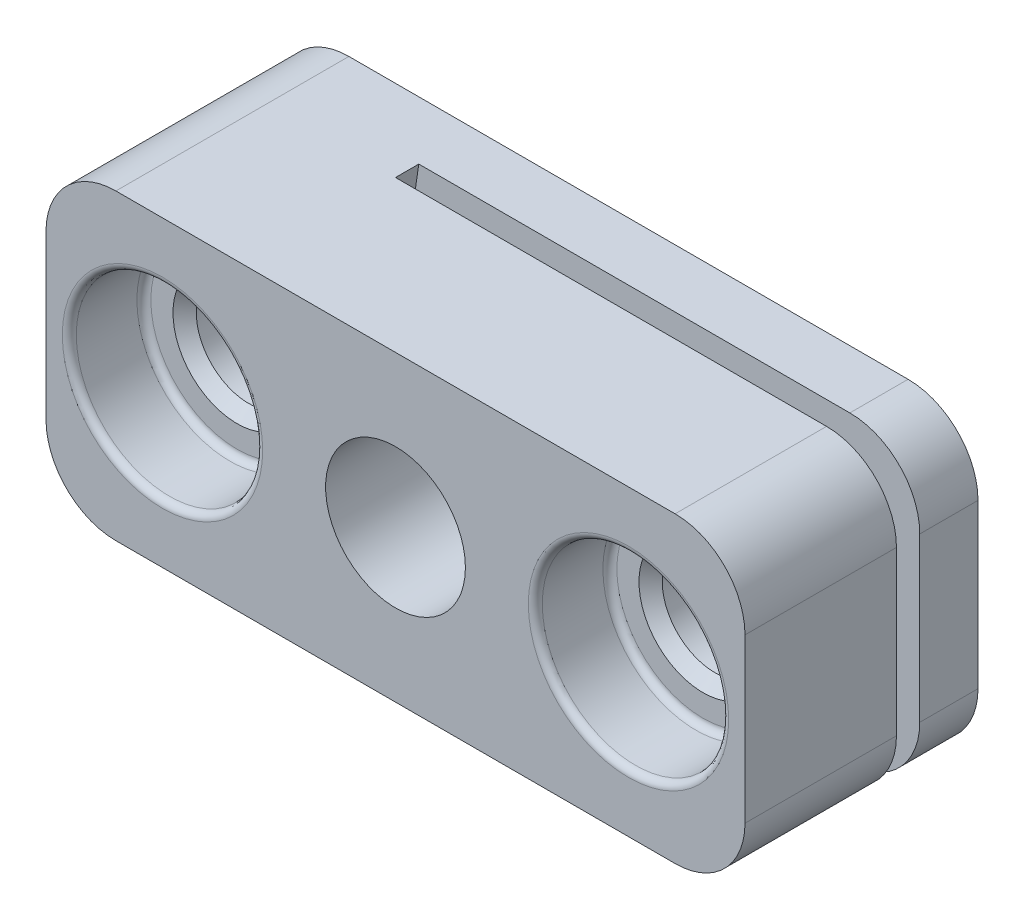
ISO-10303-21;
HEADER;
FILE_DESCRIPTION(('STEP AP214'),'2;1');
FILE_NAME('part.step','',(''),(''),'','','');
FILE_SCHEMA(('AUTOMOTIVE_DESIGN { 1 0 10303 214 1 1 1 1 }'));
ENDSEC;
DATA;
#1=APPLICATION_CONTEXT('core data for automotive mechanical design processes');
#2=APPLICATION_PROTOCOL_DEFINITION('international standard','automotive_design',2000,#1);
#3=PRODUCT_CONTEXT('',#1,'mechanical');
#4=PRODUCT('Part','Part','',(#3));
#5=PRODUCT_RELATED_PRODUCT_CATEGORY('part','',(#4));
#6=PRODUCT_DEFINITION_FORMATION('','',#4);
#7=PRODUCT_DEFINITION_CONTEXT('part definition',#1,'design');
#8=PRODUCT_DEFINITION('design','',#6,#7);
#9=PRODUCT_DEFINITION_SHAPE('','',#8);
#10=(LENGTH_UNIT() NAMED_UNIT(*) SI_UNIT(.MILLI.,.METRE.));
#11=(NAMED_UNIT(*) PLANE_ANGLE_UNIT() SI_UNIT($,.RADIAN.));
#12=(NAMED_UNIT(*) SI_UNIT($,.STERADIAN.) SOLID_ANGLE_UNIT());
#13=UNCERTAINTY_MEASURE_WITH_UNIT(LENGTH_MEASURE(1.E-05),#10,'distance_accuracy_value','');
#14=(GEOMETRIC_REPRESENTATION_CONTEXT(3) GLOBAL_UNCERTAINTY_ASSIGNED_CONTEXT((#13)) GLOBAL_UNIT_ASSIGNED_CONTEXT((#10,
#11,#12)) REPRESENTATION_CONTEXT('',''));
#15=CARTESIAN_POINT('',(0.,0.,0.));
#16=DIRECTION('',(0.,0.,1.));
#17=DIRECTION('',(1.,0.,0.));
#18=AXIS2_PLACEMENT_3D('',#15,#16,#17);
#19=CARTESIAN_POINT('',(22.75,0.,6.8));
#20=DIRECTION('',(0.,0.,1.));
#21=DIRECTION('',(1.,0.,0.));
#22=AXIS2_PLACEMENT_3D('',#19,#20,#21);
#23=PLANE('',#22);
#24=CARTESIAN_POINT('',(20.,0.,6.79999999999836));
#25=DIRECTION('',(0.,0.,1.));
#26=DIRECTION('',(1.,0.,0.));
#27=AXIS2_PLACEMENT_3D('',#24,#25,#26);
#28=CIRCLE('',#27,2.74999999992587);
#29=CARTESIAN_POINT('',(22.7499999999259,0.,6.79999999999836));
#30=VERTEX_POINT('',#29);
#31=EDGE_CURVE('E18',#30,#30,#28,.F.);
#32=ORIENTED_EDGE('',*,*,#31,.T.);
#33=EDGE_LOOP('',(#32));
#34=FACE_BOUND('',#33,.T.);
#35=CARTESIAN_POINT('',(20.,0.,6.8));
#36=DIRECTION('',(0.,0.,-1.));
#37=DIRECTION('',(1.,0.,0.));
#38=AXIS2_PLACEMENT_3D('',#35,#36,#37);
#39=CIRCLE('',#38,3.70000000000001);
#40=CARTESIAN_POINT('',(23.7,0.,6.8));
#41=VERTEX_POINT('',#40);
#42=EDGE_CURVE('E285',#41,#41,#39,.F.);
#43=ORIENTED_EDGE('',*,*,#42,.T.);
#44=EDGE_LOOP('',(#43));
#45=FACE_BOUND('',#44,.T.);
#46=ADVANCED_FACE('F14',(#34,#45),#23,.T.);
#47=CARTESIAN_POINT('',(20.,0.,7.1));
#48=DIRECTION('',(0.,0.,1.));
#49=DIRECTION('',(1.,0.,0.));
#50=AXIS2_PLACEMENT_3D('',#47,#48,#49);
#51=TOROIDAL_SURFACE('',#50,3.7,0.300000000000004);
#52=CARTESIAN_POINT('',(20.,0.,7.09999999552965));
#53=DIRECTION('',(0.,0.,-1.));
#54=DIRECTION('',(-1.,0.,0.));
#55=AXIS2_PLACEMENT_3D('',#52,#53,#54);
#56=CIRCLE('',#55,4.);
#57=CARTESIAN_POINT('',(16.,0.,7.09999999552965));
#58=VERTEX_POINT('',#57);
#59=EDGE_CURVE('E234',#58,#58,#56,.F.);
#60=ORIENTED_EDGE('',*,*,#59,.T.);
#61=EDGE_LOOP('',(#60));
#62=FACE_BOUND('',#61,.T.);
#63=ORIENTED_EDGE('',*,*,#42,.F.);
#64=EDGE_LOOP('',(#63));
#65=FACE_BOUND('',#64,.T.);
#66=ADVANCED_FACE('F267',(#62,#65),#51,.F.);
#67=CARTESIAN_POINT('',(0.,0.,7.1));
#68=DIRECTION('',(0.,0.,-1.));
#69=DIRECTION('',(-1.,0.,0.));
#70=AXIS2_PLACEMENT_3D('',#67,#68,#69);
#71=TOROIDAL_SURFACE('',#70,3.7,0.3);
#72=CARTESIAN_POINT('',(0.,0.,6.8));
#73=DIRECTION('',(0.,0.,-1.));
#74=DIRECTION('',(-1.,0.,0.));
#75=AXIS2_PLACEMENT_3D('',#72,#73,#74);
#76=CIRCLE('',#75,3.7);
#77=CARTESIAN_POINT('',(-3.7,0.,6.8));
#78=VERTEX_POINT('',#77);
#79=EDGE_CURVE('E245',#78,#78,#76,.F.);
#80=ORIENTED_EDGE('',*,*,#79,.F.);
#81=EDGE_LOOP('',(#80));
#82=FACE_BOUND('',#81,.T.);
#83=CARTESIAN_POINT('',(0.,0.,7.1));
#84=DIRECTION('',(0.,0.,1.));
#85=DIRECTION('',(1.,0.,0.));
#86=AXIS2_PLACEMENT_3D('',#83,#84,#85);
#87=CIRCLE('',#86,4.);
#88=CARTESIAN_POINT('',(4.,0.,7.1));
#89=VERTEX_POINT('',#88);
#90=EDGE_CURVE('E231',#89,#89,#87,.T.);
#91=ORIENTED_EDGE('',*,*,#90,.T.);
#92=EDGE_LOOP('',(#91));
#93=FACE_BOUND('',#92,.T.);
#94=ADVANCED_FACE('F263',(#82,#93),#71,.F.);
#95=CARTESIAN_POINT('',(-3.7,0.,6.8));
#96=DIRECTION('',(0.,0.,1.));
#97=DIRECTION('',(1.,0.,0.));
#98=AXIS2_PLACEMENT_3D('',#95,#96,#97);
#99=PLANE('',#98);
#100=ORIENTED_EDGE('',*,*,#79,.T.);
#101=EDGE_LOOP('',(#100));
#102=FACE_BOUND('',#101,.T.);
#103=CARTESIAN_POINT('',(0.,0.,6.79999999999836));
#104=DIRECTION('',(0.,0.,1.));
#105=DIRECTION('',(1.,0.,0.));
#106=AXIS2_PLACEMENT_3D('',#103,#104,#105);
#107=CIRCLE('',#106,2.75000000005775);
#108=CARTESIAN_POINT('',(2.75000000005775,0.,6.79999999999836));
#109=VERTEX_POINT('',#108);
#110=EDGE_CURVE('E228',#109,#109,#107,.F.);
#111=ORIENTED_EDGE('',*,*,#110,.T.);
#112=EDGE_LOOP('',(#111));
#113=FACE_BOUND('',#112,.T.);
#114=ADVANCED_FACE('F252',(#102,#113),#99,.T.);
#115=CARTESIAN_POINT('',(20.,0.,6.79999999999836));
#116=DIRECTION('',(0.,0.,1.));
#117=DIRECTION('',(1.,0.,0.));
#118=AXIS2_PLACEMENT_3D('',#115,#116,#117);
#119=CONICAL_SURFACE('',#118,2.74999999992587,0.785398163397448);
#120=CARTESIAN_POINT('',(20.,0.,6.3));
#121=DIRECTION('',(0.,0.,-1.));
#122=DIRECTION('',(-1.,0.,0.));
#123=AXIS2_PLACEMENT_3D('',#120,#121,#122);
#124=CIRCLE('',#123,2.25);
#125=CARTESIAN_POINT('',(17.75,0.,6.3));
#126=VERTEX_POINT('',#125);
#127=EDGE_CURVE('E224',#126,#126,#124,.T.);
#128=ORIENTED_EDGE('',*,*,#127,.T.);
#129=EDGE_LOOP('',(#128));
#130=FACE_BOUND('',#129,.T.);
#131=ORIENTED_EDGE('',*,*,#31,.F.);
#132=EDGE_LOOP('',(#131));
#133=FACE_BOUND('',#132,.T.);
#134=ADVANCED_FACE('F262',(#130,#133),#119,.F.);
#135=CARTESIAN_POINT('',(20.,0.,10.));
#136=DIRECTION('',(0.,0.,-1.));
#137=DIRECTION('',(-1.,0.,0.));
#138=AXIS2_PLACEMENT_3D('',#135,#136,#137);
#139=CYLINDRICAL_SURFACE('',#138,4.);
#140=ORIENTED_EDGE('',*,*,#59,.F.);
#141=EDGE_LOOP('',(#140));
#142=FACE_BOUND('',#141,.T.);
#143=CARTESIAN_POINT('',(20.,0.,9.7));
#144=DIRECTION('',(0.,0.,1.));
#145=DIRECTION('',(1.,0.,0.));
#146=AXIS2_PLACEMENT_3D('',#143,#144,#145);
#147=CIRCLE('',#146,4.);
#148=CARTESIAN_POINT('',(24.,0.,9.7));
#149=VERTEX_POINT('',#148);
#150=EDGE_CURVE('E125',#149,#149,#147,.F.);
#151=ORIENTED_EDGE('',*,*,#150,.F.);
#152=EDGE_LOOP('',(#151));
#153=FACE_BOUND('',#152,.T.);
#154=ADVANCED_FACE('F505',(#142,#153),#139,.F.);
#155=CARTESIAN_POINT('',(0.,0.,0.));
#156=DIRECTION('',(0.,0.,1.));
#157=DIRECTION('',(1.,0.,0.));
#158=AXIS2_PLACEMENT_3D('',#155,#156,#157);
#159=CYLINDRICAL_SURFACE('',#158,4.);
#160=CARTESIAN_POINT('',(0.,0.,9.7));
#161=DIRECTION('',(0.,0.,-1.));
#162=DIRECTION('',(-1.,0.,0.));
#163=AXIS2_PLACEMENT_3D('',#160,#161,#162);
#164=CIRCLE('',#163,4.);
#165=CARTESIAN_POINT('',(-4.,0.,9.7));
#166=VERTEX_POINT('',#165);
#167=EDGE_CURVE('E171',#166,#166,#164,.T.);
#168=ORIENTED_EDGE('',*,*,#167,.F.);
#169=EDGE_LOOP('',(#168));
#170=FACE_BOUND('',#169,.T.);
#171=ORIENTED_EDGE('',*,*,#90,.F.);
#172=EDGE_LOOP('',(#171));
#173=FACE_BOUND('',#172,.T.);
#174=ADVANCED_FACE('F349',(#170,#173),#159,.F.);
#175=CARTESIAN_POINT('',(0.,0.,6.79999999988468));
#176=DIRECTION('',(0.,0.,1.));
#177=DIRECTION('',(1.,0.,0.));
#178=AXIS2_PLACEMENT_3D('',#175,#176,#177);
#179=CONICAL_SURFACE('',#178,2.74999999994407,0.785398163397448);
#180=ORIENTED_EDGE('',*,*,#110,.F.);
#181=EDGE_LOOP('',(#180));
#182=FACE_BOUND('',#181,.T.);
#183=CARTESIAN_POINT('',(0.,0.,6.3));
#184=DIRECTION('',(0.,0.,1.));
#185=DIRECTION('',(1.,0.,0.));
#186=AXIS2_PLACEMENT_3D('',#183,#184,#185);
#187=CIRCLE('',#186,2.25);
#188=CARTESIAN_POINT('',(2.25,0.,6.3));
#189=VERTEX_POINT('',#188);
#190=EDGE_CURVE('E167',#189,#189,#187,.F.);
#191=ORIENTED_EDGE('',*,*,#190,.T.);
#192=EDGE_LOOP('',(#191));
#193=FACE_BOUND('',#192,.T.);
#194=ADVANCED_FACE('F345',(#182,#193),#179,.F.);
#195=CARTESIAN_POINT('',(20.,0.,10.));
#196=DIRECTION('',(0.,0.,-1.));
#197=DIRECTION('',(-1.,0.,0.));
#198=AXIS2_PLACEMENT_3D('',#195,#196,#197);
#199=CYLINDRICAL_SURFACE('',#198,2.25);
#200=CARTESIAN_POINT('',(20.,0.,3.5));
#201=DIRECTION('',(0.,0.,-1.));
#202=DIRECTION('',(-1.,0.,0.));
#203=AXIS2_PLACEMENT_3D('',#200,#201,#202);
#204=CIRCLE('',#203,2.25);
#205=CARTESIAN_POINT('',(17.75,0.,3.5));
#206=VERTEX_POINT('',#205);
#207=EDGE_CURVE('E135',#206,#206,#204,.T.);
#208=ORIENTED_EDGE('',*,*,#207,.T.);
#209=EDGE_LOOP('',(#208));
#210=FACE_BOUND('',#209,.T.);
#211=ORIENTED_EDGE('',*,*,#127,.F.);
#212=EDGE_LOOP('',(#211));
#213=FACE_BOUND('',#212,.T.);
#214=ADVANCED_FACE('F348',(#210,#213),#199,.F.);
#215=CARTESIAN_POINT('',(42.9683417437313,0.,3.5));
#216=DIRECTION('',(0.,0.,1.));
#217=DIRECTION('',(1.,0.,0.));
#218=AXIS2_PLACEMENT_3D('',#215,#216,#217);
#219=CYLINDRICAL_SURFACE('',#218,39.9999999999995);
#220=DIRECTION('',(0.,0.,1.));
#221=VECTOR('',#220,1.);
#222=CARTESIAN_POINT('',(3.5,6.5,3.5));
#223=LINE('',#222,#221);
#224=CARTESIAN_POINT('',(3.5,6.5,3.5));
#225=VERTEX_POINT('',#224);
#226=CARTESIAN_POINT('',(3.5,6.5,2.5));
#227=VERTEX_POINT('',#226);
#228=EDGE_CURVE('E113',#225,#227,#223,.F.);
#229=ORIENTED_EDGE('',*,*,#228,.F.);
#230=CARTESIAN_POINT('',(42.9683417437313,0.,3.5));
#231=DIRECTION('',(0.,0.,1.));
#232=DIRECTION('',(1.,0.,0.));
#233=AXIS2_PLACEMENT_3D('',#230,#231,#232);
#234=CIRCLE('',#233,39.9999999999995);
#235=CARTESIAN_POINT('',(3.50000000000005,-6.5,3.5));
#236=VERTEX_POINT('',#235);
#237=EDGE_CURVE('E177',#225,#236,#234,.T.);
#238=ORIENTED_EDGE('',*,*,#237,.T.);
#239=DIRECTION('',(0.,0.,1.));
#240=VECTOR('',#239,1.);
#241=CARTESIAN_POINT('',(3.50000000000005,-6.5,3.5));
#242=LINE('',#241,#240);
#243=CARTESIAN_POINT('',(3.50000000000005,-6.5,2.5));
#244=VERTEX_POINT('',#243);
#245=EDGE_CURVE('E126',#244,#236,#242,.T.);
#246=ORIENTED_EDGE('',*,*,#245,.F.);
#247=CARTESIAN_POINT('',(42.9683417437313,0.,2.5));
#248=DIRECTION('',(0.,0.,1.));
#249=DIRECTION('',(1.,0.,0.));
#250=AXIS2_PLACEMENT_3D('',#247,#248,#249);
#251=CIRCLE('',#250,39.9999999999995);
#252=EDGE_CURVE('E130',#227,#244,#251,.T.);
#253=ORIENTED_EDGE('',*,*,#252,.F.);
#254=EDGE_LOOP('',(#229,#238,#246,#253));
#255=FACE_BOUND('',#254,.T.);
#256=ADVANCED_FACE('F131',(#255),#219,.F.);
#257=CARTESIAN_POINT('',(20.,0.,9.7));
#258=DIRECTION('',(0.,0.,1.));
#259=DIRECTION('',(1.,0.,0.));
#260=AXIS2_PLACEMENT_3D('',#257,#258,#259);
#261=TOROIDAL_SURFACE('',#260,4.3,0.3);
#262=ORIENTED_EDGE('',*,*,#150,.T.);
#263=EDGE_LOOP('',(#262));
#264=FACE_BOUND('',#263,.T.);
#265=CARTESIAN_POINT('',(20.,0.,10.));
#266=DIRECTION('',(0.,0.,1.));
#267=DIRECTION('',(1.,0.,0.));
#268=AXIS2_PLACEMENT_3D('',#265,#266,#267);
#269=CIRCLE('',#268,4.3);
#270=CARTESIAN_POINT('',(24.3,0.,10.));
#271=VERTEX_POINT('',#270);
#272=EDGE_CURVE('E215',#271,#271,#269,.F.);
#273=ORIENTED_EDGE('',*,*,#272,.F.);
#274=EDGE_LOOP('',(#273));
#275=FACE_BOUND('',#274,.T.);
#276=ADVANCED_FACE('F189',(#264,#275),#261,.T.);
#277=CARTESIAN_POINT('',(0.,0.,9.7));
#278=DIRECTION('',(0.,0.,-1.));
#279=DIRECTION('',(-1.,0.,0.));
#280=AXIS2_PLACEMENT_3D('',#277,#278,#279);
#281=TOROIDAL_SURFACE('',#280,4.3,0.3);
#282=CARTESIAN_POINT('',(0.,0.,10.));
#283=DIRECTION('',(0.,0.,1.));
#284=DIRECTION('',(-1.,0.,0.));
#285=AXIS2_PLACEMENT_3D('',#282,#283,#284);
#286=CIRCLE('',#285,4.3);
#287=CARTESIAN_POINT('',(-4.3,0.,10.));
#288=VERTEX_POINT('',#287);
#289=EDGE_CURVE('E331',#288,#288,#286,.F.);
#290=ORIENTED_EDGE('',*,*,#289,.F.);
#291=EDGE_LOOP('',(#290));
#292=FACE_BOUND('',#291,.T.);
#293=ORIENTED_EDGE('',*,*,#167,.T.);
#294=EDGE_LOOP('',(#293));
#295=FACE_BOUND('',#294,.T.);
#296=ADVANCED_FACE('F183',(#292,#295),#281,.T.);
#297=CARTESIAN_POINT('',(25.,-3.5,10.));
#298=DIRECTION('',(-1.,0.,0.));
#299=DIRECTION('',(0.,0.,1.));
#300=AXIS2_PLACEMENT_3D('',#297,#298,#299);
#301=PLANE('',#300);
#302=DIRECTION('',(0.,1.,0.));
#303=VECTOR('',#302,1.);
#304=CARTESIAN_POINT('',(25.,0.,3.5));
#305=LINE('',#304,#303);
#306=CARTESIAN_POINT('',(25.,-3.5,3.5));
#307=VERTEX_POINT('',#306);
#308=CARTESIAN_POINT('',(25.,3.5,3.5));
#309=VERTEX_POINT('',#308);
#310=EDGE_CURVE('E334',#307,#309,#305,.T.);
#311=ORIENTED_EDGE('',*,*,#310,.T.);
#312=DIRECTION('',(0.,0.,1.));
#313=VECTOR('',#312,1.);
#314=CARTESIAN_POINT('',(25.,3.5,10.));
#315=LINE('',#314,#313);
#316=CARTESIAN_POINT('',(25.,3.5,10.));
#317=VERTEX_POINT('',#316);
#318=EDGE_CURVE('E174',#317,#309,#315,.F.);
#319=ORIENTED_EDGE('',*,*,#318,.F.);
#320=DIRECTION('',(0.,1.,0.));
#321=VECTOR('',#320,1.);
#322=CARTESIAN_POINT('',(25.,-3.5,10.));
#323=LINE('',#322,#321);
#324=CARTESIAN_POINT('',(25.,-3.5,10.));
#325=VERTEX_POINT('',#324);
#326=EDGE_CURVE('E327',#325,#317,#323,.T.);
#327=ORIENTED_EDGE('',*,*,#326,.F.);
#328=DIRECTION('',(0.,0.,1.));
#329=VECTOR('',#328,1.);
#330=CARTESIAN_POINT('',(25.,-3.5,10.));
#331=LINE('',#330,#329);
#332=EDGE_CURVE('E170',#307,#325,#331,.T.);
#333=ORIENTED_EDGE('',*,*,#332,.F.);
#334=EDGE_LOOP('',(#311,#319,#327,#333));
#335=FACE_BOUND('',#334,.T.);
#336=ADVANCED_FACE('F188',(#335),#301,.F.);
#337=CARTESIAN_POINT('',(20.,0.,10.));
#338=DIRECTION('',(0.,0.,-1.));
#339=DIRECTION('',(-1.,0.,0.));
#340=AXIS2_PLACEMENT_3D('',#337,#338,#339);
#341=CYLINDRICAL_SURFACE('',#340,2.25);
#342=CARTESIAN_POINT('',(20.,0.,0.499999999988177));
#343=DIRECTION('',(0.,0.,-1.));
#344=DIRECTION('',(-1.,0.,0.));
#345=AXIS2_PLACEMENT_3D('',#342,#343,#344);
#346=CIRCLE('',#345,2.25000000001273);
#347=CARTESIAN_POINT('',(17.7499999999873,0.,0.499999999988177));
#348=VERTEX_POINT('',#347);
#349=EDGE_CURVE('E326',#348,#348,#346,.T.);
#350=ORIENTED_EDGE('',*,*,#349,.T.);
#351=EDGE_LOOP('',(#350));
#352=FACE_BOUND('',#351,.T.);
#353=CARTESIAN_POINT('',(20.,0.,2.5));
#354=DIRECTION('',(0.,0.,-1.));
#355=DIRECTION('',(-1.,0.,0.));
#356=AXIS2_PLACEMENT_3D('',#353,#354,#355);
#357=CIRCLE('',#356,2.25);
#358=CARTESIAN_POINT('',(17.75,0.,2.5));
#359=VERTEX_POINT('',#358);
#360=EDGE_CURVE('E136',#359,#359,#357,.T.);
#361=ORIENTED_EDGE('',*,*,#360,.F.);
#362=EDGE_LOOP('',(#361));
#363=FACE_BOUND('',#362,.T.);
#364=ADVANCED_FACE('F357',(#352,#363),#341,.F.);
#365=CARTESIAN_POINT('',(0.,0.,0.));
#366=DIRECTION('',(0.,0.,1.));
#367=DIRECTION('',(1.,0.,0.));
#368=AXIS2_PLACEMENT_3D('',#365,#366,#367);
#369=CYLINDRICAL_SURFACE('',#368,2.25);
#370=ORIENTED_EDGE('',*,*,#190,.F.);
#371=EDGE_LOOP('',(#370));
#372=FACE_BOUND('',#371,.T.);
#373=CARTESIAN_POINT('',(0.,0.,0.499999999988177));
#374=DIRECTION('',(0.,0.,-1.));
#375=DIRECTION('',(-1.,0.,0.));
#376=AXIS2_PLACEMENT_3D('',#373,#374,#375);
#377=CIRCLE('',#376,2.2499999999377);
#378=CARTESIAN_POINT('',(-2.2499999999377,0.,0.499999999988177));
#379=VERTEX_POINT('',#378);
#380=EDGE_CURVE('E323',#379,#379,#377,.T.);
#381=ORIENTED_EDGE('',*,*,#380,.T.);
#382=EDGE_LOOP('',(#381));
#383=FACE_BOUND('',#382,.T.);
#384=ADVANCED_FACE('F353',(#372,#383),#369,.F.);
#385=CARTESIAN_POINT('',(22.,-3.5,10.));
#386=DIRECTION('',(0.,0.,1.));
#387=DIRECTION('',(1.,0.,0.));
#388=AXIS2_PLACEMENT_3D('',#385,#386,#387);
#389=CYLINDRICAL_SURFACE('',#388,3.);
#390=ORIENTED_EDGE('',*,*,#332,.T.);
#391=CARTESIAN_POINT('',(22.,-3.5,10.));
#392=DIRECTION('',(0.,0.,1.));
#393=DIRECTION('',(1.,0.,0.));
#394=AXIS2_PLACEMENT_3D('',#391,#392,#393);
#395=CIRCLE('',#394,3.);
#396=CARTESIAN_POINT('',(22.,-6.5,10.));
#397=VERTEX_POINT('',#396);
#398=EDGE_CURVE('E328',#397,#325,#395,.T.);
#399=ORIENTED_EDGE('',*,*,#398,.F.);
#400=DIRECTION('',(0.,0.,1.));
#401=VECTOR('',#400,1.);
#402=CARTESIAN_POINT('',(22.,-6.5,10.));
#403=LINE('',#402,#401);
#404=CARTESIAN_POINT('',(22.,-6.5,3.5));
#405=VERTEX_POINT('',#404);
#406=EDGE_CURVE('E157',#397,#405,#403,.F.);
#407=ORIENTED_EDGE('',*,*,#406,.T.);
#408=CARTESIAN_POINT('',(22.,-3.5,3.5));
#409=DIRECTION('',(0.,0.,1.));
#410=DIRECTION('',(1.,0.,0.));
#411=AXIS2_PLACEMENT_3D('',#408,#409,#410);
#412=CIRCLE('',#411,3.);
#413=EDGE_CURVE('E335',#405,#307,#412,.T.);
#414=ORIENTED_EDGE('',*,*,#413,.T.);
#415=EDGE_LOOP('',(#390,#399,#407,#414));
#416=FACE_BOUND('',#415,.T.);
#417=ADVANCED_FACE('F356',(#416),#389,.T.);
#418=CARTESIAN_POINT('',(42.9683417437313,0.,2.5));
#419=DIRECTION('',(0.,0.,1.));
#420=DIRECTION('',(1.,0.,0.));
#421=AXIS2_PLACEMENT_3D('',#418,#419,#420);
#422=PLANE('',#421);
#423=CARTESIAN_POINT('',(10.,0.,2.5));
#424=DIRECTION('',(0.,0.,1.));
#425=DIRECTION('',(1.,0.,0.));
#426=AXIS2_PLACEMENT_3D('',#423,#424,#425);
#427=CIRCLE('',#426,3.00000000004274);
#428=CARTESIAN_POINT('',(13.0000000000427,0.,2.5));
#429=VERTEX_POINT('',#428);
#430=EDGE_CURVE('E455',#429,#429,#427,.T.);
#431=ORIENTED_EDGE('',*,*,#430,.F.);
#432=EDGE_LOOP('',(#431));
#433=FACE_BOUND('',#432,.T.);
#434=ORIENTED_EDGE('',*,*,#252,.T.);
#435=DIRECTION('',(1.,0.,0.));
#436=VECTOR('',#435,1.);
#437=CARTESIAN_POINT('',(-2.,-6.5,2.5));
#438=LINE('',#437,#436);
#439=CARTESIAN_POINT('',(22.,-6.5,2.5));
#440=VERTEX_POINT('',#439);
#441=EDGE_CURVE('E153',#244,#440,#438,.T.);
#442=ORIENTED_EDGE('',*,*,#441,.T.);
#443=CARTESIAN_POINT('',(22.,-3.5,2.5));
#444=DIRECTION('',(0.,0.,1.));
#445=DIRECTION('',(1.,0.,0.));
#446=AXIS2_PLACEMENT_3D('',#443,#444,#445);
#447=CIRCLE('',#446,3.);
#448=CARTESIAN_POINT('',(25.,-3.5,2.5));
#449=VERTEX_POINT('',#448);
#450=EDGE_CURVE('E164',#449,#440,#447,.F.);
#451=ORIENTED_EDGE('',*,*,#450,.F.);
#452=DIRECTION('',(0.,1.,0.));
#453=VECTOR('',#452,1.);
#454=CARTESIAN_POINT('',(25.,-3.5,2.5));
#455=LINE('',#454,#453);
#456=CARTESIAN_POINT('',(25.,3.5,2.5));
#457=VERTEX_POINT('',#456);
#458=EDGE_CURVE('E150',#449,#457,#455,.T.);
#459=ORIENTED_EDGE('',*,*,#458,.T.);
#460=CARTESIAN_POINT('',(22.,3.5,2.5));
#461=DIRECTION('',(0.,0.,1.));
#462=DIRECTION('',(1.,0.,0.));
#463=AXIS2_PLACEMENT_3D('',#460,#461,#462);
#464=CIRCLE('',#463,3.);
#465=CARTESIAN_POINT('',(22.,6.5,2.5));
#466=VERTEX_POINT('',#465);
#467=EDGE_CURVE('E141',#466,#457,#464,.F.);
#468=ORIENTED_EDGE('',*,*,#467,.F.);
#469=DIRECTION('',(1.,0.,0.));
#470=VECTOR('',#469,1.);
#471=CARTESIAN_POINT('',(22.,6.5,2.5));
#472=LINE('',#471,#470);
#473=EDGE_CURVE('E117',#466,#227,#472,.F.);
#474=ORIENTED_EDGE('',*,*,#473,.T.);
#475=EDGE_LOOP('',(#434,#442,#451,#459,#468,#474));
#476=FACE_BOUND('',#475,.T.);
#477=ORIENTED_EDGE('',*,*,#360,.T.);
#478=EDGE_LOOP('',(#477));
#479=FACE_BOUND('',#478,.T.);
#480=ADVANCED_FACE('F138',(#433,#476,#479),#422,.T.);
#481=CARTESIAN_POINT('',(42.9683417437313,0.,3.5));
#482=DIRECTION('',(0.,0.,1.));
#483=DIRECTION('',(1.,0.,0.));
#484=AXIS2_PLACEMENT_3D('',#481,#482,#483);
#485=PLANE('',#484);
#486=CARTESIAN_POINT('',(10.,0.,3.5));
#487=DIRECTION('',(0.,0.,1.));
#488=DIRECTION('',(1.,0.,0.));
#489=AXIS2_PLACEMENT_3D('',#486,#487,#488);
#490=CIRCLE('',#489,3.00000000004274);
#491=CARTESIAN_POINT('',(13.0000000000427,0.,3.5));
#492=VERTEX_POINT('',#491);
#493=EDGE_CURVE('E458',#492,#492,#490,.T.);
#494=ORIENTED_EDGE('',*,*,#493,.T.);
#495=EDGE_LOOP('',(#494));
#496=FACE_BOUND('',#495,.T.);
#497=ORIENTED_EDGE('',*,*,#237,.F.);
#498=DIRECTION('',(1.,0.,0.));
#499=VECTOR('',#498,1.);
#500=CARTESIAN_POINT('',(22.,6.5,3.5));
#501=LINE('',#500,#499);
#502=CARTESIAN_POINT('',(22.,6.5,3.5));
#503=VERTEX_POINT('',#502);
#504=EDGE_CURVE('E121',#225,#503,#501,.T.);
#505=ORIENTED_EDGE('',*,*,#504,.T.);
#506=CARTESIAN_POINT('',(22.,3.5,3.5));
#507=DIRECTION('',(0.,0.,1.));
#508=DIRECTION('',(1.,0.,0.));
#509=AXIS2_PLACEMENT_3D('',#506,#507,#508);
#510=CIRCLE('',#509,3.);
#511=EDGE_CURVE('E176',#309,#503,#510,.T.);
#512=ORIENTED_EDGE('',*,*,#511,.F.);
#513=ORIENTED_EDGE('',*,*,#310,.F.);
#514=ORIENTED_EDGE('',*,*,#413,.F.);
#515=DIRECTION('',(1.,0.,0.));
#516=VECTOR('',#515,1.);
#517=CARTESIAN_POINT('',(-2.,-6.5,3.5));
#518=LINE('',#517,#516);
#519=EDGE_CURVE('E160',#405,#236,#518,.F.);
#520=ORIENTED_EDGE('',*,*,#519,.T.);
#521=EDGE_LOOP('',(#497,#505,#512,#513,#514,#520));
#522=FACE_BOUND('',#521,.T.);
#523=ORIENTED_EDGE('',*,*,#207,.F.);
#524=EDGE_LOOP('',(#523));
#525=FACE_BOUND('',#524,.T.);
#526=ADVANCED_FACE('F418',(#496,#522,#525),#485,.F.);
#527=CARTESIAN_POINT('',(22.,3.5,10.));
#528=DIRECTION('',(0.,0.,1.));
#529=DIRECTION('',(1.,0.,0.));
#530=AXIS2_PLACEMENT_3D('',#527,#528,#529);
#531=CYLINDRICAL_SURFACE('',#530,3.);
#532=DIRECTION('',(0.,0.,-1.));
#533=VECTOR('',#532,1.);
#534=CARTESIAN_POINT('',(22.,6.5,10.));
#535=LINE('',#534,#533);
#536=CARTESIAN_POINT('',(22.,6.5,10.));
#537=VERTEX_POINT('',#536);
#538=EDGE_CURVE('E144',#503,#537,#535,.F.);
#539=ORIENTED_EDGE('',*,*,#538,.T.);
#540=CARTESIAN_POINT('',(22.,3.5,10.));
#541=DIRECTION('',(0.,0.,1.));
#542=DIRECTION('',(1.,0.,0.));
#543=AXIS2_PLACEMENT_3D('',#540,#541,#542);
#544=CIRCLE('',#543,3.);
#545=EDGE_CURVE('E324',#317,#537,#544,.T.);
#546=ORIENTED_EDGE('',*,*,#545,.F.);
#547=ORIENTED_EDGE('',*,*,#318,.T.);
#548=ORIENTED_EDGE('',*,*,#511,.T.);
#549=EDGE_LOOP('',(#539,#546,#547,#548));
#550=FACE_BOUND('',#549,.T.);
#551=ADVANCED_FACE('F394',(#550),#531,.T.);
#552=CARTESIAN_POINT('',(-2.,-3.5,10.));
#553=DIRECTION('',(0.,0.,1.));
#554=DIRECTION('',(1.,0.,0.));
#555=AXIS2_PLACEMENT_3D('',#552,#553,#554);
#556=PLANE('',#555);
#557=DIRECTION('',(1.,0.,0.));
#558=VECTOR('',#557,1.);
#559=CARTESIAN_POINT('',(22.,6.5,10.));
#560=LINE('',#559,#558);
#561=CARTESIAN_POINT('',(-2.,6.5,10.));
#562=VERTEX_POINT('',#561);
#563=EDGE_CURVE('E146',#537,#562,#560,.F.);
#564=ORIENTED_EDGE('',*,*,#563,.T.);
#565=CARTESIAN_POINT('',(-2.,3.5,10.));
#566=DIRECTION('',(0.,0.,1.));
#567=DIRECTION('',(1.,0.,0.));
#568=AXIS2_PLACEMENT_3D('',#565,#566,#567);
#569=CIRCLE('',#568,3.);
#570=CARTESIAN_POINT('',(-5.,3.5,10.));
#571=VERTEX_POINT('',#570);
#572=EDGE_CURVE('E315',#571,#562,#569,.F.);
#573=ORIENTED_EDGE('',*,*,#572,.F.);
#574=DIRECTION('',(0.,1.,0.));
#575=VECTOR('',#574,1.);
#576=CARTESIAN_POINT('',(-5.,3.5,10.));
#577=LINE('',#576,#575);
#578=CARTESIAN_POINT('',(-5.,-3.5,10.));
#579=VERTEX_POINT('',#578);
#580=EDGE_CURVE('E372',#571,#579,#577,.F.);
#581=ORIENTED_EDGE('',*,*,#580,.T.);
#582=CARTESIAN_POINT('',(-2.,-3.5,10.));
#583=DIRECTION('',(0.,0.,1.));
#584=DIRECTION('',(1.,0.,0.));
#585=AXIS2_PLACEMENT_3D('',#582,#583,#584);
#586=CIRCLE('',#585,3.);
#587=CARTESIAN_POINT('',(-2.,-6.5,10.));
#588=VERTEX_POINT('',#587);
#589=EDGE_CURVE('E156',#588,#579,#586,.F.);
#590=ORIENTED_EDGE('',*,*,#589,.F.);
#591=DIRECTION('',(1.,0.,0.));
#592=VECTOR('',#591,1.);
#593=CARTESIAN_POINT('',(-2.,-6.5,10.));
#594=LINE('',#593,#592);
#595=EDGE_CURVE('E161',#588,#397,#594,.T.);
#596=ORIENTED_EDGE('',*,*,#595,.T.);
#597=ORIENTED_EDGE('',*,*,#398,.T.);
#598=ORIENTED_EDGE('',*,*,#326,.T.);
#599=ORIENTED_EDGE('',*,*,#545,.T.);
#600=EDGE_LOOP('',(#564,#573,#581,#590,#596,#597,#598,#599));
#601=FACE_BOUND('',#600,.T.);
#602=CARTESIAN_POINT('',(10.,0.,10.));
#603=DIRECTION('',(0.,0.,1.));
#604=DIRECTION('',(1.,0.,0.));
#605=AXIS2_PLACEMENT_3D('',#602,#603,#604);
#606=CIRCLE('',#605,3.00000000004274);
#607=CARTESIAN_POINT('',(13.0000000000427,0.,10.));
#608=VERTEX_POINT('',#607);
#609=EDGE_CURVE('E462',#608,#608,#606,.T.);
#610=ORIENTED_EDGE('',*,*,#609,.F.);
#611=EDGE_LOOP('',(#610));
#612=FACE_BOUND('',#611,.T.);
#613=ORIENTED_EDGE('',*,*,#289,.T.);
#614=EDGE_LOOP('',(#613));
#615=FACE_BOUND('',#614,.T.);
#616=ORIENTED_EDGE('',*,*,#272,.T.);
#617=EDGE_LOOP('',(#616));
#618=FACE_BOUND('',#617,.T.);
#619=ADVANCED_FACE('F383',(#601,#612,#615,#618),#556,.T.);
#620=CARTESIAN_POINT('',(20.,0.,5.6843418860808E-11));
#621=DIRECTION('',(0.,0.,-1.));
#622=DIRECTION('',(-1.,0.,0.));
#623=AXIS2_PLACEMENT_3D('',#620,#621,#622);
#624=CONICAL_SURFACE('',#623,2.74999999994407,0.785398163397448);
#625=CARTESIAN_POINT('',(20.,0.,5.6843418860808E-11));
#626=DIRECTION('',(0.,0.,-1.));
#627=DIRECTION('',(-1.,0.,0.));
#628=AXIS2_PLACEMENT_3D('',#625,#626,#627);
#629=CIRCLE('',#628,2.74999999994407);
#630=CARTESIAN_POINT('',(17.2500000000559,0.,5.6843418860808E-11));
#631=VERTEX_POINT('',#630);
#632=EDGE_CURVE('E311',#631,#631,#629,.T.);
#633=ORIENTED_EDGE('',*,*,#632,.T.);
#634=EDGE_LOOP('',(#633));
#635=FACE_BOUND('',#634,.T.);
#636=ORIENTED_EDGE('',*,*,#349,.F.);
#637=EDGE_LOOP('',(#636));
#638=FACE_BOUND('',#637,.T.);
#639=ADVANCED_FACE('F393',(#635,#638),#624,.F.);
#640=CARTESIAN_POINT('',(0.,0.,0.));
#641=DIRECTION('',(0.,0.,-1.));
#642=DIRECTION('',(-1.,0.,0.));
#643=AXIS2_PLACEMENT_3D('',#640,#641,#642);
#644=CONICAL_SURFACE('',#643,2.74999999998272,0.785398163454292);
#645=ORIENTED_EDGE('',*,*,#380,.F.);
#646=EDGE_LOOP('',(#645));
#647=FACE_BOUND('',#646,.T.);
#648=CARTESIAN_POINT('',(0.,0.,0.));
#649=DIRECTION('',(0.,0.,-1.));
#650=DIRECTION('',(-1.,0.,0.));
#651=AXIS2_PLACEMENT_3D('',#648,#649,#650);
#652=CIRCLE('',#651,2.74999999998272);
#653=CARTESIAN_POINT('',(-2.74999999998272,0.,0.));
#654=VERTEX_POINT('',#653);
#655=EDGE_CURVE('E308',#654,#654,#652,.T.);
#656=ORIENTED_EDGE('',*,*,#655,.T.);
#657=EDGE_LOOP('',(#656));
#658=FACE_BOUND('',#657,.T.);
#659=ADVANCED_FACE('F633',(#647,#658),#644,.F.);
#660=CARTESIAN_POINT('',(-2.,-3.5,10.));
#661=DIRECTION('',(0.,0.,1.));
#662=DIRECTION('',(1.,0.,0.));
#663=AXIS2_PLACEMENT_3D('',#660,#661,#662);
#664=CYLINDRICAL_SURFACE('',#663,3.);
#665=ORIENTED_EDGE('',*,*,#589,.T.);
#666=DIRECTION('',(0.,0.,-1.));
#667=VECTOR('',#666,1.);
#668=CARTESIAN_POINT('',(-5.,-3.5,10.));
#669=LINE('',#668,#667);
#670=CARTESIAN_POINT('',(-5.,-3.5,0.));
#671=VERTEX_POINT('',#670);
#672=EDGE_CURVE('E314',#579,#671,#669,.T.);
#673=ORIENTED_EDGE('',*,*,#672,.T.);
#674=CARTESIAN_POINT('',(-2.,-3.5,0.));
#675=DIRECTION('',(0.,0.,1.));
#676=DIRECTION('',(1.,0.,0.));
#677=AXIS2_PLACEMENT_3D('',#674,#675,#676);
#678=CIRCLE('',#677,3.);
#679=CARTESIAN_POINT('',(-2.,-6.5,0.));
#680=VERTEX_POINT('',#679);
#681=EDGE_CURVE('E305',#671,#680,#678,.T.);
#682=ORIENTED_EDGE('',*,*,#681,.T.);
#683=DIRECTION('',(0.,0.,1.));
#684=VECTOR('',#683,1.);
#685=CARTESIAN_POINT('',(-2.,-6.5,10.));
#686=LINE('',#685,#684);
#687=EDGE_CURVE('E155',#680,#588,#686,.T.);
#688=ORIENTED_EDGE('',*,*,#687,.T.);
#689=EDGE_LOOP('',(#665,#673,#682,#688));
#690=FACE_BOUND('',#689,.T.);
#691=ADVANCED_FACE('F642',(#690),#664,.T.);
#692=CARTESIAN_POINT('',(-2.,-6.5,10.));
#693=DIRECTION('',(0.,1.,0.));
#694=DIRECTION('',(0.,0.,1.));
#695=AXIS2_PLACEMENT_3D('',#692,#693,#694);
#696=PLANE('',#695);
#697=ORIENTED_EDGE('',*,*,#519,.F.);
#698=ORIENTED_EDGE('',*,*,#406,.F.);
#699=ORIENTED_EDGE('',*,*,#595,.F.);
#700=ORIENTED_EDGE('',*,*,#687,.F.);
#701=DIRECTION('',(1.,0.,0.));
#702=VECTOR('',#701,1.);
#703=CARTESIAN_POINT('',(-2.,-6.5,0.));
#704=LINE('',#703,#702);
#705=CARTESIAN_POINT('',(22.,-6.5,0.));
#706=VERTEX_POINT('',#705);
#707=EDGE_CURVE('E304',#680,#706,#704,.T.);
#708=ORIENTED_EDGE('',*,*,#707,.T.);
#709=DIRECTION('',(0.,0.,1.));
#710=VECTOR('',#709,1.);
#711=CARTESIAN_POINT('',(22.,-6.5,10.));
#712=LINE('',#711,#710);
#713=EDGE_CURVE('E321',#440,#706,#712,.F.);
#714=ORIENTED_EDGE('',*,*,#713,.F.);
#715=ORIENTED_EDGE('',*,*,#441,.F.);
#716=ORIENTED_EDGE('',*,*,#245,.T.);
#717=EDGE_LOOP('',(#697,#698,#699,#700,#708,#714,#715,#716));
#718=FACE_BOUND('',#717,.T.);
#719=ADVANCED_FACE('F431',(#718),#696,.F.);
#720=CARTESIAN_POINT('',(22.,-3.5,10.));
#721=DIRECTION('',(0.,0.,1.));
#722=DIRECTION('',(1.,0.,0.));
#723=AXIS2_PLACEMENT_3D('',#720,#721,#722);
#724=CYLINDRICAL_SURFACE('',#723,3.);
#725=CARTESIAN_POINT('',(22.,-3.5,0.));
#726=DIRECTION('',(0.,0.,1.));
#727=DIRECTION('',(1.,0.,0.));
#728=AXIS2_PLACEMENT_3D('',#725,#726,#727);
#729=CIRCLE('',#728,3.);
#730=CARTESIAN_POINT('',(25.,-3.5,0.));
#731=VERTEX_POINT('',#730);
#732=EDGE_CURVE('E301',#706,#731,#729,.T.);
#733=ORIENTED_EDGE('',*,*,#732,.T.);
#734=DIRECTION('',(0.,0.,1.));
#735=VECTOR('',#734,1.);
#736=CARTESIAN_POINT('',(25.,-3.5,10.));
#737=LINE('',#736,#735);
#738=EDGE_CURVE('E152',#731,#449,#737,.T.);
#739=ORIENTED_EDGE('',*,*,#738,.T.);
#740=ORIENTED_EDGE('',*,*,#450,.T.);
#741=ORIENTED_EDGE('',*,*,#713,.T.);
#742=EDGE_LOOP('',(#733,#739,#740,#741));
#743=FACE_BOUND('',#742,.T.);
#744=ADVANCED_FACE('F443',(#743),#724,.T.);
#745=CARTESIAN_POINT('',(25.,-3.5,10.));
#746=DIRECTION('',(-1.,0.,0.));
#747=DIRECTION('',(0.,0.,1.));
#748=AXIS2_PLACEMENT_3D('',#745,#746,#747);
#749=PLANE('',#748);
#750=ORIENTED_EDGE('',*,*,#738,.F.);
#751=DIRECTION('',(0.,1.,0.));
#752=VECTOR('',#751,1.);
#753=CARTESIAN_POINT('',(25.,-3.5,0.));
#754=LINE('',#753,#752);
#755=CARTESIAN_POINT('',(25.,3.5,0.));
#756=VERTEX_POINT('',#755);
#757=EDGE_CURVE('E300',#731,#756,#754,.T.);
#758=ORIENTED_EDGE('',*,*,#757,.T.);
#759=DIRECTION('',(0.,0.,1.));
#760=VECTOR('',#759,1.);
#761=CARTESIAN_POINT('',(25.,3.5,10.));
#762=LINE('',#761,#760);
#763=EDGE_CURVE('E319',#457,#756,#762,.F.);
#764=ORIENTED_EDGE('',*,*,#763,.F.);
#765=ORIENTED_EDGE('',*,*,#458,.F.);
#766=EDGE_LOOP('',(#750,#758,#764,#765));
#767=FACE_BOUND('',#766,.T.);
#768=ADVANCED_FACE('F440',(#767),#749,.F.);
#769=CARTESIAN_POINT('',(22.,3.5,10.));
#770=DIRECTION('',(0.,0.,1.));
#771=DIRECTION('',(1.,0.,0.));
#772=AXIS2_PLACEMENT_3D('',#769,#770,#771);
#773=CYLINDRICAL_SURFACE('',#772,3.);
#774=CARTESIAN_POINT('',(22.,3.5,0.));
#775=DIRECTION('',(0.,0.,1.));
#776=DIRECTION('',(1.,0.,0.));
#777=AXIS2_PLACEMENT_3D('',#774,#775,#776);
#778=CIRCLE('',#777,3.);
#779=CARTESIAN_POINT('',(22.,6.5,0.));
#780=VERTEX_POINT('',#779);
#781=EDGE_CURVE('E297',#756,#780,#778,.T.);
#782=ORIENTED_EDGE('',*,*,#781,.T.);
#783=DIRECTION('',(0.,0.,-1.));
#784=VECTOR('',#783,1.);
#785=CARTESIAN_POINT('',(22.,6.5,10.));
#786=LINE('',#785,#784);
#787=EDGE_CURVE('E142',#780,#466,#786,.F.);
#788=ORIENTED_EDGE('',*,*,#787,.T.);
#789=ORIENTED_EDGE('',*,*,#467,.T.);
#790=ORIENTED_EDGE('',*,*,#763,.T.);
#791=EDGE_LOOP('',(#782,#788,#789,#790));
#792=FACE_BOUND('',#791,.T.);
#793=ADVANCED_FACE('F675',(#792),#773,.T.);
#794=CARTESIAN_POINT('',(22.,6.5,10.));
#795=DIRECTION('',(0.,-1.,0.));
#796=DIRECTION('',(0.,0.,-1.));
#797=AXIS2_PLACEMENT_3D('',#794,#795,#796);
#798=PLANE('',#797);
#799=ORIENTED_EDGE('',*,*,#504,.F.);
#800=ORIENTED_EDGE('',*,*,#228,.T.);
#801=ORIENTED_EDGE('',*,*,#473,.F.);
#802=ORIENTED_EDGE('',*,*,#787,.F.);
#803=DIRECTION('',(1.,0.,0.));
#804=VECTOR('',#803,1.);
#805=CARTESIAN_POINT('',(-2.,6.5,0.));
#806=LINE('',#805,#804);
#807=CARTESIAN_POINT('',(-2.,6.5,0.));
#808=VERTEX_POINT('',#807);
#809=EDGE_CURVE('E296',#780,#808,#806,.F.);
#810=ORIENTED_EDGE('',*,*,#809,.T.);
#811=DIRECTION('',(0.,0.,1.));
#812=VECTOR('',#811,1.);
#813=CARTESIAN_POINT('',(-2.,6.5,10.));
#814=LINE('',#813,#812);
#815=EDGE_CURVE('E317',#562,#808,#814,.F.);
#816=ORIENTED_EDGE('',*,*,#815,.F.);
#817=ORIENTED_EDGE('',*,*,#563,.F.);
#818=ORIENTED_EDGE('',*,*,#538,.F.);
#819=EDGE_LOOP('',(#799,#800,#801,#802,#810,#816,#817,#818));
#820=FACE_BOUND('',#819,.T.);
#821=ADVANCED_FACE('F115',(#820),#798,.F.);
#822=CARTESIAN_POINT('',(-2.,3.5,10.));
#823=DIRECTION('',(0.,0.,1.));
#824=DIRECTION('',(1.,0.,0.));
#825=AXIS2_PLACEMENT_3D('',#822,#823,#824);
#826=CYLINDRICAL_SURFACE('',#825,3.);
#827=ORIENTED_EDGE('',*,*,#572,.T.);
#828=ORIENTED_EDGE('',*,*,#815,.T.);
#829=CARTESIAN_POINT('',(-2.,3.5,0.));
#830=DIRECTION('',(0.,0.,1.));
#831=DIRECTION('',(1.,0.,0.));
#832=AXIS2_PLACEMENT_3D('',#829,#830,#831);
#833=CIRCLE('',#832,3.);
#834=CARTESIAN_POINT('',(-5.,3.5,0.));
#835=VERTEX_POINT('',#834);
#836=EDGE_CURVE('E24',#808,#835,#833,.T.);
#837=ORIENTED_EDGE('',*,*,#836,.T.);
#838=DIRECTION('',(0.,0.,-1.));
#839=VECTOR('',#838,1.);
#840=CARTESIAN_POINT('',(-5.,3.5,10.));
#841=LINE('',#840,#839);
#842=EDGE_CURVE('E32',#835,#571,#841,.F.);
#843=ORIENTED_EDGE('',*,*,#842,.T.);
#844=EDGE_LOOP('',(#827,#828,#837,#843));
#845=FACE_BOUND('',#844,.T.);
#846=ADVANCED_FACE('F693',(#845),#826,.T.);
#847=CARTESIAN_POINT('',(-5.,3.5,10.));
#848=DIRECTION('',(1.,0.,0.));
#849=DIRECTION('',(0.,0.,-1.));
#850=AXIS2_PLACEMENT_3D('',#847,#848,#849);
#851=PLANE('',#850);
#852=ORIENTED_EDGE('',*,*,#672,.F.);
#853=ORIENTED_EDGE('',*,*,#580,.F.);
#854=ORIENTED_EDGE('',*,*,#842,.F.);
#855=DIRECTION('',(0.,1.,0.));
#856=VECTOR('',#855,1.);
#857=CARTESIAN_POINT('',(-5.,-3.5,0.));
#858=LINE('',#857,#856);
#859=EDGE_CURVE('E9',#835,#671,#858,.F.);
#860=ORIENTED_EDGE('',*,*,#859,.T.);
#861=EDGE_LOOP('',(#852,#853,#854,#860));
#862=FACE_BOUND('',#861,.T.);
#863=ADVANCED_FACE('F482',(#862),#851,.F.);
#864=CARTESIAN_POINT('',(-2.,-3.5,0.));
#865=DIRECTION('',(0.,0.,1.));
#866=DIRECTION('',(1.,0.,0.));
#867=AXIS2_PLACEMENT_3D('',#864,#865,#866);
#868=PLANE('',#867);
#869=ORIENTED_EDGE('',*,*,#836,.F.);
#870=ORIENTED_EDGE('',*,*,#809,.F.);
#871=ORIENTED_EDGE('',*,*,#781,.F.);
#872=ORIENTED_EDGE('',*,*,#757,.F.);
#873=ORIENTED_EDGE('',*,*,#732,.F.);
#874=ORIENTED_EDGE('',*,*,#707,.F.);
#875=ORIENTED_EDGE('',*,*,#681,.F.);
#876=ORIENTED_EDGE('',*,*,#859,.F.);
#877=EDGE_LOOP('',(#869,#870,#871,#872,#873,#874,#875,#876));
#878=FACE_BOUND('',#877,.T.);
#879=CARTESIAN_POINT('',(10.,0.,-5.6843418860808E-11));
#880=DIRECTION('',(0.,0.,1.));
#881=DIRECTION('',(1.,0.,0.));
#882=AXIS2_PLACEMENT_3D('',#879,#880,#881);
#883=CIRCLE('',#882,3.00000000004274);
#884=CARTESIAN_POINT('',(13.0000000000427,0.,-5.6843418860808E-11));
#885=VERTEX_POINT('',#884);
#886=EDGE_CURVE('E461',#885,#885,#883,.T.);
#887=ORIENTED_EDGE('',*,*,#886,.T.);
#888=EDGE_LOOP('',(#887));
#889=FACE_BOUND('',#888,.T.);
#890=ORIENTED_EDGE('',*,*,#655,.F.);
#891=EDGE_LOOP('',(#890));
#892=FACE_BOUND('',#891,.T.);
#893=ORIENTED_EDGE('',*,*,#632,.F.);
#894=EDGE_LOOP('',(#893));
#895=FACE_BOUND('',#894,.T.);
#896=ADVANCED_FACE('F468',(#878,#889,#892,#895),#868,.F.);
#897=CARTESIAN_POINT('',(10.,0.,-5.6843418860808E-11));
#898=DIRECTION('',(0.,0.,1.));
#899=DIRECTION('',(1.,0.,0.));
#900=AXIS2_PLACEMENT_3D('',#897,#898,#899);
#901=CYLINDRICAL_SURFACE('',#900,3.00000000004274);
#902=ORIENTED_EDGE('',*,*,#430,.T.);
#903=EDGE_LOOP('',(#902));
#904=FACE_BOUND('',#903,.T.);
#905=ORIENTED_EDGE('',*,*,#886,.F.);
#906=EDGE_LOOP('',(#905));
#907=FACE_BOUND('',#906,.T.);
#908=ADVANCED_FACE('F471',(#904,#907),#901,.F.);
#909=ORIENTED_EDGE('',*,*,#609,.T.);
#910=EDGE_LOOP('',(#909));
#911=FACE_BOUND('',#910,.T.);
#912=ORIENTED_EDGE('',*,*,#493,.F.);
#913=EDGE_LOOP('',(#912));
#914=FACE_BOUND('',#913,.T.);
#915=ADVANCED_FACE('F473',(#911,#914),#901,.F.);
#916=CLOSED_SHELL('',(#46,#66,#94,#114,#134,#154,#174,#194,#214,#256,#276,#296,#336,#364,#384,
#417,#480,#526,#551,#619,#639,#659,#691,#719,#744,#768,#793,#821,#846,#863,#896,#908,#915));
#917=MANIFOLD_SOLID_BREP('B1',#916);
#918=ADVANCED_BREP_SHAPE_REPRESENTATION('',(#18,#917),#14);
#919=SHAPE_DEFINITION_REPRESENTATION(#9,#918);
ENDSEC;
END-ISO-10303-21;
